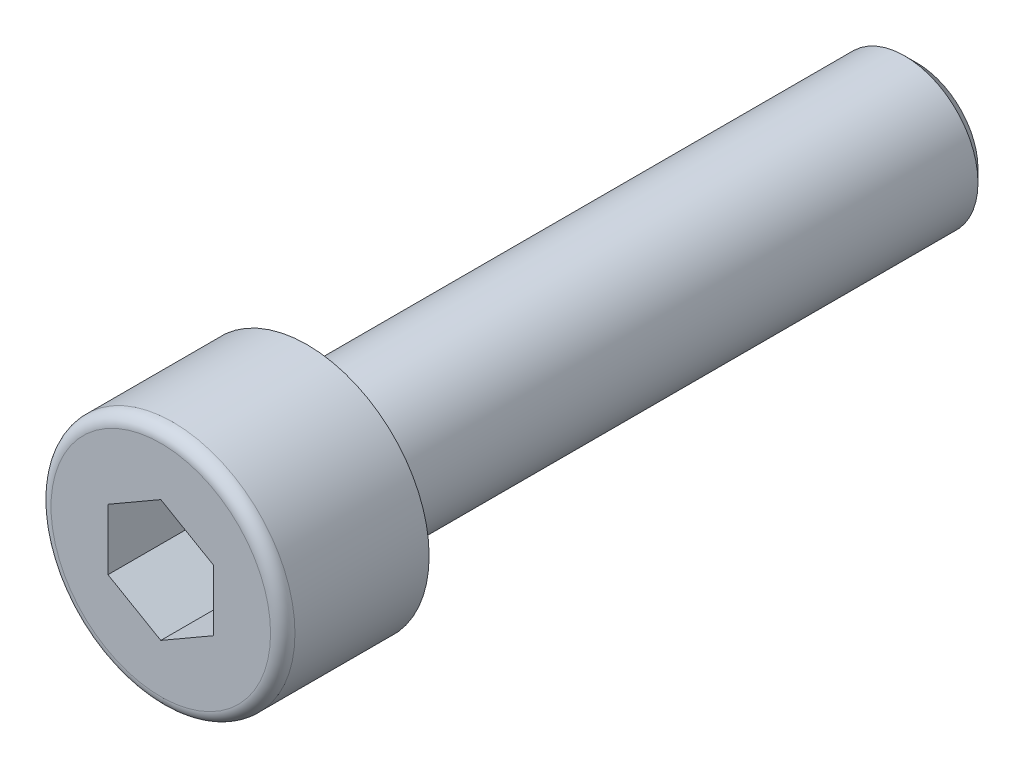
from build123d import *

# Parameters (mm, degrees)
ESQUISSE1_R             = 3
BASE_EXTRUSION_DEPTH    = 31
CHANFREIN1_SIZE         = 0.5
ESQUISSE2_R             = 5
BOSS_EXTRU_1_DEPTH      = 6
ENL_V_MAT_EXTRU_1_DEPTH = 3.5
CONG_2_R                = 0.5


with BuildPart() as part:
    # Esquisse1 → Base-Extrusion (new body)
    with BuildSketch(Plane.XY):
        Circle(ESQUISSE1_R)
    extrude(amount=BASE_EXTRUSION_DEPTH)

    # Chanfrein1
    chanfrein1_edges = [part.edges().sort_by_distance(p)[0] for p in [
        (-3, 0, 0),
    ]]
    chamfer(chanfrein1_edges, length=CHANFREIN1_SIZE)

    # Esquisse2 → Boss.-Extru.1 (add)
    with BuildSketch(Plane.XY.offset(25)):
        Circle(ESQUISSE2_R)
    extrude(amount=BOSS_EXTRU_1_DEPTH)

    # Esquisse3 → Enl_v. mat.-Extru.1 (cut)
    with BuildSketch(Plane.XY.offset(31)):
        Polygon((0, 2.5), (-2.165063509, 1.25), (-2.165063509, -1.25), (0, -2.5), (2.165063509, -1.25), (2.165063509, 1.25), align=None)
    extrude(amount=-ENL_V_MAT_EXTRU_1_DEPTH, mode=Mode.SUBTRACT)

    # Cong_2
    cong_2_edges = [part.edges().sort_by_distance(p)[0] for p in [
        (-5, 0, 31),
    ]]
    fillet(cong_2_edges, radius=CONG_2_R)


solid = part.part
